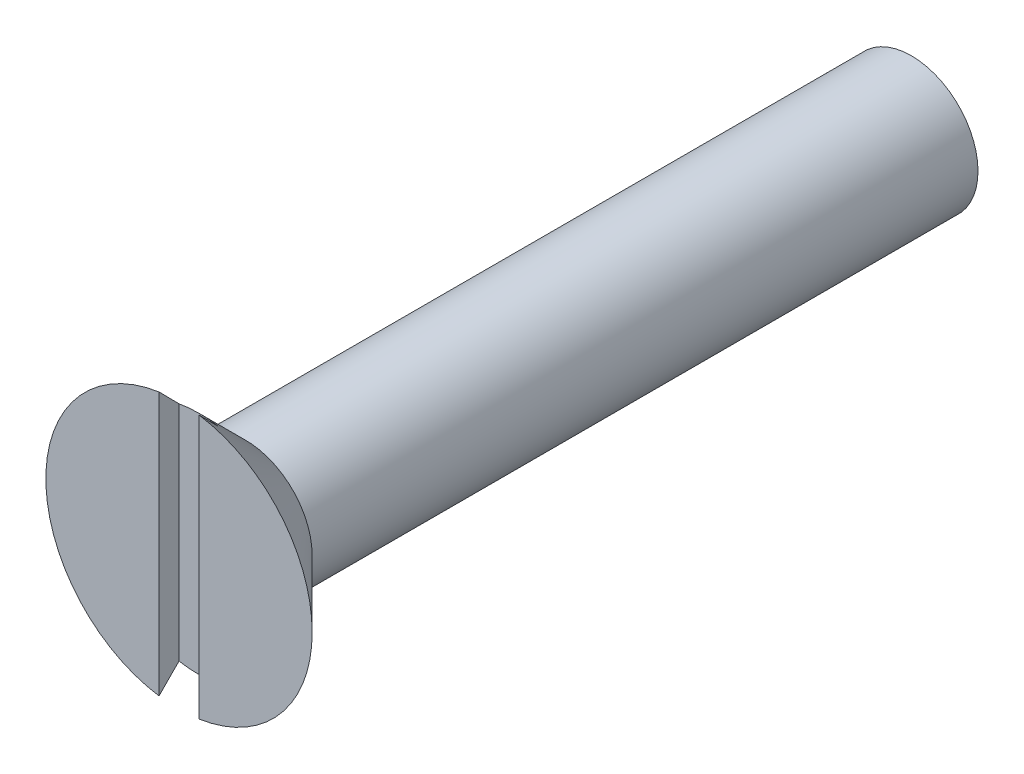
ISO-10303-21;
HEADER;
FILE_DESCRIPTION(('STEP AP214'),'2;1');
FILE_NAME('part.step','',(''),(''),'','','');
FILE_SCHEMA(('AUTOMOTIVE_DESIGN { 1 0 10303 214 1 1 1 1 }'));
ENDSEC;
DATA;
#1=APPLICATION_CONTEXT('core data for automotive mechanical design processes');
#2=APPLICATION_PROTOCOL_DEFINITION('international standard','automotive_design',2000,#1);
#3=PRODUCT_CONTEXT('',#1,'mechanical');
#4=PRODUCT('Part','Part','',(#3));
#5=PRODUCT_RELATED_PRODUCT_CATEGORY('part','',(#4));
#6=PRODUCT_DEFINITION_FORMATION('','',#4);
#7=PRODUCT_DEFINITION_CONTEXT('part definition',#1,'design');
#8=PRODUCT_DEFINITION('design','',#6,#7);
#9=PRODUCT_DEFINITION_SHAPE('','',#8);
#10=(LENGTH_UNIT() NAMED_UNIT(*) SI_UNIT(.MILLI.,.METRE.));
#11=(NAMED_UNIT(*) PLANE_ANGLE_UNIT() SI_UNIT($,.RADIAN.));
#12=(NAMED_UNIT(*) SI_UNIT($,.STERADIAN.) SOLID_ANGLE_UNIT());
#13=UNCERTAINTY_MEASURE_WITH_UNIT(LENGTH_MEASURE(1.E-05),#10,'distance_accuracy_value','');
#14=(GEOMETRIC_REPRESENTATION_CONTEXT(3) GLOBAL_UNCERTAINTY_ASSIGNED_CONTEXT((#13)) GLOBAL_UNIT_ASSIGNED_CONTEXT((#10,
#11,#12)) REPRESENTATION_CONTEXT('',''));
#15=CARTESIAN_POINT('',(0.,0.,0.));
#16=DIRECTION('',(0.,0.,1.));
#17=DIRECTION('',(1.,0.,0.));
#18=AXIS2_PLACEMENT_3D('',#15,#16,#17);
#19=CARTESIAN_POINT('',(0.,0.,0.));
#20=DIRECTION('',(0.,0.,1.));
#21=DIRECTION('',(1.,0.,0.));
#22=AXIS2_PLACEMENT_3D('',#19,#20,#21);
#23=PLANE('',#22);
#24=CARTESIAN_POINT('',(0.,0.,0.));
#25=DIRECTION('',(0.,0.,1.));
#26=DIRECTION('',(1.,0.,0.));
#27=AXIS2_PLACEMENT_3D('',#24,#25,#26);
#28=CIRCLE('',#27,2.);
#29=CARTESIAN_POINT('',(0.3,-1.97737199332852,0.));
#30=VERTEX_POINT('',#29);
#31=CARTESIAN_POINT('',(0.3,1.97737199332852,0.));
#32=VERTEX_POINT('',#31);
#33=EDGE_CURVE('E87',#30,#32,#28,.T.);
#34=ORIENTED_EDGE('',*,*,#33,.T.);
#35=DIRECTION('',(0.,-1.,0.));
#36=VECTOR('',#35,1.);
#37=CARTESIAN_POINT('',(0.3,-4.54142135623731,0.));
#38=LINE('',#37,#36);
#39=EDGE_CURVE('E77',#32,#30,#38,.T.);
#40=ORIENTED_EDGE('',*,*,#39,.T.);
#41=EDGE_LOOP('',(#34,#40));
#42=FACE_BOUND('',#41,.T.);
#43=ADVANCED_FACE('F31',(#42),#23,.T.);
#44=CARTESIAN_POINT('',(0.,0.,0.));
#45=DIRECTION('',(0.,0.,1.));
#46=DIRECTION('',(1.,0.,0.));
#47=AXIS2_PLACEMENT_3D('',#44,#45,#46);
#48=CONICAL_SURFACE('',#47,2.,0.78539816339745);
#49=CARTESIAN_POINT('',(0.,0.,-1.));
#50=DIRECTION('',(0.,0.,1.));
#51=DIRECTION('',(1.,0.,0.));
#52=AXIS2_PLACEMENT_3D('',#49,#50,#51);
#53=CIRCLE('',#52,0.999999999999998);
#54=CARTESIAN_POINT('',(0.999999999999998,0.,-1.));
#55=VERTEX_POINT('',#54);
#56=EDGE_CURVE('E96',#55,#55,#53,.F.);
#57=ORIENTED_EDGE('',*,*,#56,.F.);
#58=EDGE_LOOP('',(#57));
#59=FACE_BOUND('',#58,.T.);
#60=ORIENTED_EDGE('',*,*,#33,.F.);
#61=CARTESIAN_POINT('',(0.3,-4.35723583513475,2.36755127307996));
#62=CARTESIAN_POINT('',(0.3,-4.20650886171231,2.21718326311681));
#63=CARTESIAN_POINT('',(0.3,-4.05576625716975,2.06683090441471));
#64=CARTESIAN_POINT('',(0.3,-3.75422559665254,1.76617444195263));
#65=CARTESIAN_POINT('',(0.3,-3.60342753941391,1.61587033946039));
#66=CARTESIAN_POINT('',(0.3,-3.30167482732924,1.31525068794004));
#67=CARTESIAN_POINT('',(0.3,-3.15072013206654,1.16493517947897));
#68=CARTESIAN_POINT('',(0.3,-2.84870469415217,0.864417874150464));
#69=CARTESIAN_POINT('',(0.3,-2.6976439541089,0.714216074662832));
#70=CARTESIAN_POINT('',(0.3,-2.39501199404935,0.413663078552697));
#71=CARTESIAN_POINT('',(0.3,-2.24344038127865,0.263312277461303));
#72=CARTESIAN_POINT('',(0.3,-1.93997662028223,-0.0370872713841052));
#73=CARTESIAN_POINT('',(0.3,-1.78808445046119,-0.187135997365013));
#74=CARTESIAN_POINT('',(0.3,-1.55978354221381,-0.41168534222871));
#75=CARTESIAN_POINT('',(0.3,-1.48361955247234,-0.48643474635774));
#76=CARTESIAN_POINT('',(0.3,-1.3310320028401,-0.635673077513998));
#77=CARTESIAN_POINT('',(0.3,-1.2546084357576,-0.710161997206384));
#78=CARTESIAN_POINT('',(0.3,-1.10134132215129,-0.858686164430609));
#79=CARTESIAN_POINT('',(0.3,-1.02449783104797,-0.932721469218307));
#80=CARTESIAN_POINT('',(0.3,-0.870048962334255,-1.07999205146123));
#81=CARTESIAN_POINT('',(0.3,-0.792443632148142,-1.15322737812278));
#82=CARTESIAN_POINT('',(0.3,-0.692630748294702,-1.24523273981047));
#83=CARTESIAN_POINT('',(0.3,-0.6712087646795,-1.26485302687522));
#84=CARTESIAN_POINT('',(0.3,-0.628194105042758,-1.30390701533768));
#85=CARTESIAN_POINT('',(0.3,-0.606601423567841,-1.32334071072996));
#86=CARTESIAN_POINT('',(0.3,-0.563173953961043,-1.36198273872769));
#87=CARTESIAN_POINT('',(0.3,-0.541338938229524,-1.38119081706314));
#88=CARTESIAN_POINT('',(0.3,-0.497372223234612,-1.41925890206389));
#89=CARTESIAN_POINT('',(0.3,-0.475240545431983,-1.43811893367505));
#90=CARTESIAN_POINT('',(0.3,-0.416321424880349,-1.48726021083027));
#91=CARTESIAN_POINT('',(0.3,-0.379195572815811,-1.51714816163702));
#92=CARTESIAN_POINT('',(0.3,-0.322050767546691,-1.56004185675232));
#93=CARTESIAN_POINT('',(0.3,-0.302762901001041,-1.57401471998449));
#94=CARTESIAN_POINT('',(0.3,-0.26350754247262,-1.60096272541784));
#95=CARTESIAN_POINT('',(0.3,-0.243540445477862,-1.61393843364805));
#96=CARTESIAN_POINT('',(0.3,-0.20334327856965,-1.63792735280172));
#97=CARTESIAN_POINT('',(0.3,-0.183144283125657,-1.64899164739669));
#98=CARTESIAN_POINT('',(0.3,-0.141604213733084,-1.6687609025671));
#99=CARTESIAN_POINT('',(0.3,-0.120264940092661,-1.67746945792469));
#100=CARTESIAN_POINT('',(0.3,-0.0809502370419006,-1.6897055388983));
#101=CARTESIAN_POINT('',(0.3,-0.063202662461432,-1.69393516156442));
#102=CARTESIAN_POINT('',(0.3,-0.0272639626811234,-1.69928300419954));
#103=CARTESIAN_POINT('',(0.3,-0.00907417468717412,-1.70040965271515));
#104=CARTESIAN_POINT('',(0.3,0.0272221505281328,-1.69931595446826));
#105=CARTESIAN_POINT('',(0.3,0.0453285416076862,-1.69709107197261));
#106=CARTESIAN_POINT('',(0.3,0.080959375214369,-1.68976243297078));
#107=CARTESIAN_POINT('',(0.3,0.0984822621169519,-1.6846515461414));
#108=CARTESIAN_POINT('',(0.3,0.135914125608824,-1.67119599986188));
#109=CARTESIAN_POINT('',(0.3,0.155665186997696,-1.66242813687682));
#110=CARTESIAN_POINT('',(0.3,0.19423079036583,-1.64300207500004));
#111=CARTESIAN_POINT('',(0.3,0.213043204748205,-1.63233981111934));
#112=CARTESIAN_POINT('',(0.3,0.250084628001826,-1.60971073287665));
#113=CARTESIAN_POINT('',(0.3,0.26830693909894,-1.59773313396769));
#114=CARTESIAN_POINT('',(0.3,0.304163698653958,-1.57297643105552));
#115=CARTESIAN_POINT('',(0.3,0.321798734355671,-1.5601981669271));
#116=CARTESIAN_POINT('',(0.3,0.377839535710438,-1.51823511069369));
#117=CARTESIAN_POINT('',(0.3,0.415441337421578,-1.48798470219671));
#118=CARTESIAN_POINT('',(0.3,0.4895646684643,-1.4261811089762));
#119=CARTESIAN_POINT('',(0.3,0.526085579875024,-1.39462720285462));
#120=CARTESIAN_POINT('',(0.3,0.598524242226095,-1.33071705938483));
#121=CARTESIAN_POINT('',(0.3,0.634440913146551,-1.29835959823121));
#122=CARTESIAN_POINT('',(0.3,0.705838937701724,-1.23318881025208));
#123=CARTESIAN_POINT('',(0.3,0.741320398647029,-1.20037560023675));
#124=CARTESIAN_POINT('',(0.3,0.846985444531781,-1.10181840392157));
#125=CARTESIAN_POINT('',(0.3,0.916753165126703,-1.03562919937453));
#126=CARTESIAN_POINT('',(0.3,1.05565579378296,-0.902721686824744));
#127=CARTESIAN_POINT('',(0.3,1.12479122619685,-0.836003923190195));
#128=CARTESIAN_POINT('',(0.3,1.32673241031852,-0.640170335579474));
#129=CARTESIAN_POINT('',(0.3,1.45909445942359,-0.510597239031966));
#130=CARTESIAN_POINT('',(0.3,1.72330984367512,-0.250931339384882));
#131=CARTESIAN_POINT('',(0.3,1.85516316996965,-0.120838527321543));
#132=CARTESIAN_POINT('',(0.3,2.11864758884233,0.139690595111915));
#133=CARTESIAN_POINT('',(0.3,2.25027855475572,0.270127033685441));
#134=CARTESIAN_POINT('',(0.3,2.51337540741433,0.531164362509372));
#135=CARTESIAN_POINT('',(0.3,2.64484129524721,0.661765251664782));
#136=CARTESIAN_POINT('',(0.3,3.04009381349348,1.0547255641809));
#137=CARTESIAN_POINT('',(0.3,3.303724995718,1.31724134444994));
#138=CARTESIAN_POINT('',(0.3,3.69896427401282,1.71109506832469));
#139=CARTESIAN_POINT('',(0.3,3.83064413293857,1.84236106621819));
#140=CARTESIAN_POINT('',(0.3,4.0939658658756,2.10493052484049));
#141=CARTESIAN_POINT('',(0.3,4.22560773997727,2.23623398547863));
#142=CARTESIAN_POINT('',(0.3,4.35723583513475,2.36755127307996));
#143=B_SPLINE_CURVE_WITH_KNOTS('',3,(#61,#62,#63,#64,#65,#66,#67,#68,#69,#70,#71,#72,#73,#74,
#75,#76,#77,#78,#79,#80,#81,#82,#83,#84,#85,#86,#87,#88,#89,#90,#91,#92,#93,#94,#95,#96,#97,#98,
#99,#100,#101,#102,#103,#104,#105,#106,#107,#108,#109,#110,#111,#112,#113,#114,#115,#116,#117,
#118,#119,#120,#121,#122,#123,#124,#125,#126,#127,#128,#129,#130,#131,#132,#133,#134,#135,#136,
#137,#138,#139,#140,#141,#142),.UNSPECIFIED.,.F.,.F.,(4,2,2,2,2,2,2,2,2,2,2,2,2,2,2,2,2,2,2,2,2,
2,2,2,2,2,2,2,2,2,2,2,2,2,2,2,2,2,2,2,4),(0.,0.638719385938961,1.27745436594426,
1.91654639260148,2.55562321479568,3.19610253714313,3.83662648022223,4.15677597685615,
4.47693441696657,4.79705157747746,5.11714893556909,5.20429565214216,5.29144516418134,
5.37868494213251,5.4659184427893,5.60882875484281,5.68026197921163,5.75165435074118,
5.82066147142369,5.88956268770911,5.94407872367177,5.99844653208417,6.0528879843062,
6.10746453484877,6.17213269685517,6.23694133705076,6.30232785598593,6.36764689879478,
6.51234963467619,6.65713355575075,6.80215344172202,6.94713682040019,7.2356357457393,
7.52386855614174,8.07954320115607,8.63522747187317,9.19116173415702,9.74709231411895,
10.8632207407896,11.421013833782,11.9788055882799),.UNSPECIFIED.);
#144=CARTESIAN_POINT('',(0.3,-1.67332005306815,-0.3));
#145=VERTEX_POINT('',#144);
#146=EDGE_CURVE('E11',#30,#145,#143,.T.);
#147=ORIENTED_EDGE('',*,*,#146,.T.);
#148=CARTESIAN_POINT('',(0.,0.,-0.3));
#149=DIRECTION('',(0.,0.,1.));
#150=DIRECTION('',(1.,0.,0.));
#151=AXIS2_PLACEMENT_3D('',#148,#149,#150);
#152=CIRCLE('',#151,1.7);
#153=CARTESIAN_POINT('',(-0.3,-1.67332005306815,-0.3));
#154=VERTEX_POINT('',#153);
#155=EDGE_CURVE('E90',#145,#154,#152,.F.);
#156=ORIENTED_EDGE('',*,*,#155,.T.);
#157=CARTESIAN_POINT('',(-0.3,-4.35723583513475,2.36755127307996));
#158=CARTESIAN_POINT('',(-0.3,-4.20650886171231,2.21718326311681));
#159=CARTESIAN_POINT('',(-0.3,-4.05576625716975,2.06683090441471));
#160=CARTESIAN_POINT('',(-0.3,-3.75422559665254,1.76617444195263));
#161=CARTESIAN_POINT('',(-0.3,-3.60342753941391,1.61587033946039));
#162=CARTESIAN_POINT('',(-0.3,-3.30167482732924,1.31525068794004));
#163=CARTESIAN_POINT('',(-0.3,-3.15072013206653,1.16493517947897));
#164=CARTESIAN_POINT('',(-0.3,-2.84870469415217,0.864417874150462));
#165=CARTESIAN_POINT('',(-0.3,-2.6976439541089,0.71421607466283));
#166=CARTESIAN_POINT('',(-0.3,-2.39501199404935,0.413663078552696));
#167=CARTESIAN_POINT('',(-0.3,-2.24344038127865,0.263312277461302));
#168=CARTESIAN_POINT('',(-0.3,-1.93997662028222,-0.0370872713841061));
#169=CARTESIAN_POINT('',(-0.3,-1.78808445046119,-0.187135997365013));
#170=CARTESIAN_POINT('',(-0.3,-1.55978354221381,-0.411685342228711));
#171=CARTESIAN_POINT('',(-0.3,-1.48361955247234,-0.486434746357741));
#172=CARTESIAN_POINT('',(-0.3,-1.3310320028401,-0.635673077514));
#173=CARTESIAN_POINT('',(-0.3,-1.2546084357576,-0.710161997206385));
#174=CARTESIAN_POINT('',(-0.3,-1.10134132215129,-0.85868616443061));
#175=CARTESIAN_POINT('',(-0.3,-1.02449783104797,-0.932721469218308));
#176=CARTESIAN_POINT('',(-0.3,-0.870048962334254,-1.07999205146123));
#177=CARTESIAN_POINT('',(-0.3,-0.792443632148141,-1.15322737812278));
#178=CARTESIAN_POINT('',(-0.3,-0.692630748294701,-1.24523273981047));
#179=CARTESIAN_POINT('',(-0.3,-0.671208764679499,-1.26485302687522));
#180=CARTESIAN_POINT('',(-0.3,-0.628194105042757,-1.30390701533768));
#181=CARTESIAN_POINT('',(-0.3,-0.60660142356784,-1.32334071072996));
#182=CARTESIAN_POINT('',(-0.3,-0.563173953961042,-1.36198273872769));
#183=CARTESIAN_POINT('',(-0.3,-0.541338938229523,-1.38119081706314));
#184=CARTESIAN_POINT('',(-0.3,-0.497372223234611,-1.41925890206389));
#185=CARTESIAN_POINT('',(-0.3,-0.475240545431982,-1.43811893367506));
#186=CARTESIAN_POINT('',(-0.3,-0.416321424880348,-1.48726021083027));
#187=CARTESIAN_POINT('',(-0.3,-0.37919557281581,-1.51714816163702));
#188=CARTESIAN_POINT('',(-0.3,-0.32205076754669,-1.56004185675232));
#189=CARTESIAN_POINT('',(-0.3,-0.30276290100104,-1.57401471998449));
#190=CARTESIAN_POINT('',(-0.3,-0.263507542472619,-1.60096272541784));
#191=CARTESIAN_POINT('',(-0.3,-0.243540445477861,-1.61393843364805));
#192=CARTESIAN_POINT('',(-0.3,-0.203343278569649,-1.63792735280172));
#193=CARTESIAN_POINT('',(-0.3,-0.183144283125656,-1.64899164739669));
#194=CARTESIAN_POINT('',(-0.3,-0.141604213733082,-1.6687609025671));
#195=CARTESIAN_POINT('',(-0.3,-0.12026494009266,-1.67746945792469));
#196=CARTESIAN_POINT('',(-0.3,-0.0809502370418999,-1.6897055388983));
#197=CARTESIAN_POINT('',(-0.3,-0.0632026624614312,-1.69393516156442));
#198=CARTESIAN_POINT('',(-0.3,-0.0272639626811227,-1.69928300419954));
#199=CARTESIAN_POINT('',(-0.3,-0.00907417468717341,-1.70040965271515));
#200=CARTESIAN_POINT('',(-0.3,0.0272221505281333,-1.69931595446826));
#201=CARTESIAN_POINT('',(-0.3,0.0453285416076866,-1.69709107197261));
#202=CARTESIAN_POINT('',(-0.3,0.0809593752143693,-1.68976243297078));
#203=CARTESIAN_POINT('',(-0.3,0.0984822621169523,-1.6846515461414));
#204=CARTESIAN_POINT('',(-0.3,0.135914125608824,-1.67119599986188));
#205=CARTESIAN_POINT('',(-0.3,0.155665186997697,-1.66242813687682));
#206=CARTESIAN_POINT('',(-0.3,0.194230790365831,-1.64300207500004));
#207=CARTESIAN_POINT('',(-0.3,0.213043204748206,-1.63233981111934));
#208=CARTESIAN_POINT('',(-0.3,0.250084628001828,-1.60971073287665));
#209=CARTESIAN_POINT('',(-0.3,0.268306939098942,-1.59773313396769));
#210=CARTESIAN_POINT('',(-0.3,0.30416369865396,-1.57297643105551));
#211=CARTESIAN_POINT('',(-0.3,0.321798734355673,-1.5601981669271));
#212=CARTESIAN_POINT('',(-0.3,0.37783953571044,-1.51823511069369));
#213=CARTESIAN_POINT('',(-0.3,0.41544133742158,-1.48798470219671));
#214=CARTESIAN_POINT('',(-0.3,0.489564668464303,-1.42618110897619));
#215=CARTESIAN_POINT('',(-0.3,0.526085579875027,-1.39462720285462));
#216=CARTESIAN_POINT('',(-0.3,0.598524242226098,-1.33071705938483));
#217=CARTESIAN_POINT('',(-0.3,0.634440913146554,-1.29835959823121));
#218=CARTESIAN_POINT('',(-0.3,0.705838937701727,-1.23318881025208));
#219=CARTESIAN_POINT('',(-0.3,0.741320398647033,-1.20037560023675));
#220=CARTESIAN_POINT('',(-0.3,0.846985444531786,-1.10181840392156));
#221=CARTESIAN_POINT('',(-0.3,0.916753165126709,-1.03562919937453));
#222=CARTESIAN_POINT('',(-0.3,1.05565579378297,-0.902721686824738));
#223=CARTESIAN_POINT('',(-0.3,1.12479122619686,-0.836003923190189));
#224=CARTESIAN_POINT('',(-0.3,1.32673241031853,-0.640170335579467));
#225=CARTESIAN_POINT('',(-0.3,1.45909445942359,-0.510597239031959));
#226=CARTESIAN_POINT('',(-0.3,1.72330984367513,-0.250931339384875));
#227=CARTESIAN_POINT('',(-0.3,1.85516316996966,-0.120838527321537));
#228=CARTESIAN_POINT('',(-0.3,2.11864758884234,0.139690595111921));
#229=CARTESIAN_POINT('',(-0.3,2.25027855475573,0.270127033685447));
#230=CARTESIAN_POINT('',(-0.3,2.51337540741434,0.531164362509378));
#231=CARTESIAN_POINT('',(-0.3,2.64484129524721,0.661765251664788));
#232=CARTESIAN_POINT('',(-0.3,3.04009381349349,1.0547255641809));
#233=CARTESIAN_POINT('',(-0.3,3.30372499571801,1.31724134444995));
#234=CARTESIAN_POINT('',(-0.3,3.69896427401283,1.71109506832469));
#235=CARTESIAN_POINT('',(-0.3,3.83064413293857,1.84236106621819));
#236=CARTESIAN_POINT('',(-0.3,4.0939658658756,2.10493052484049));
#237=CARTESIAN_POINT('',(-0.3,4.22560773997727,2.23623398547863));
#238=CARTESIAN_POINT('',(-0.3,4.35723583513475,2.36755127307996));
#239=B_SPLINE_CURVE_WITH_KNOTS('',3,(#157,#158,#159,#160,#161,#162,#163,#164,#165,#166,#167,
#168,#169,#170,#171,#172,#173,#174,#175,#176,#177,#178,#179,#180,#181,#182,#183,#184,#185,#186,
#187,#188,#189,#190,#191,#192,#193,#194,#195,#196,#197,#198,#199,#200,#201,#202,#203,#204,#205,
#206,#207,#208,#209,#210,#211,#212,#213,#214,#215,#216,#217,#218,#219,#220,#221,#222,#223,#224,
#225,#226,#227,#228,#229,#230,#231,#232,#233,#234,#235,#236,#237,#238),.UNSPECIFIED.,.F.,.F.,(4,
2,2,2,2,2,2,2,2,2,2,2,2,2,2,2,2,2,2,2,2,2,2,2,2,2,2,2,2,2,2,2,2,2,2,2,2,2,2,2,4),(0.,
0.638719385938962,1.27745436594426,1.91654639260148,2.55562321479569,3.19610253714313,
3.83662648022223,4.15677597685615,4.47693441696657,4.79705157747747,5.11714893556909,
5.20429565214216,5.29144516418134,5.37868494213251,5.4659184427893,5.60882875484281,
5.68026197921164,5.75165435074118,5.8206614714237,5.88956268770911,5.94407872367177,
5.99844653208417,6.0528879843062,6.10746453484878,6.17213269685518,6.23694133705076,
6.30232785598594,6.36764689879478,6.5123496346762,6.65713355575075,6.80215344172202,
6.94713682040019,7.23563574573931,7.52386855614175,8.07954320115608,8.63522747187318,
9.19116173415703,9.74709231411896,10.8632207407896,11.421013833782,11.9788055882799),.UNSPECIFIED.);
#240=CARTESIAN_POINT('',(-0.3,-1.97737199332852,0.));
#241=VERTEX_POINT('',#240);
#242=EDGE_CURVE('E45',#241,#154,#239,.T.);
#243=ORIENTED_EDGE('',*,*,#242,.F.);
#244=CARTESIAN_POINT('',(-0.3,1.97737199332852,0.));
#245=VERTEX_POINT('',#244);
#246=EDGE_CURVE('E92',#245,#241,#28,.T.);
#247=ORIENTED_EDGE('',*,*,#246,.F.);
#248=CARTESIAN_POINT('',(-0.3,1.67332005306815,-0.3));
#249=VERTEX_POINT('',#248);
#250=EDGE_CURVE('E91',#249,#245,#239,.T.);
#251=ORIENTED_EDGE('',*,*,#250,.F.);
#252=CARTESIAN_POINT('',(0.3,1.67332005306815,-0.3));
#253=VERTEX_POINT('',#252);
#254=EDGE_CURVE('E89',#249,#253,#152,.F.);
#255=ORIENTED_EDGE('',*,*,#254,.T.);
#256=EDGE_CURVE('E36',#253,#32,#143,.T.);
#257=ORIENTED_EDGE('',*,*,#256,.T.);
#258=EDGE_LOOP('',(#60,#147,#156,#243,#247,#251,#255,#257));
#259=FACE_BOUND('',#258,.T.);
#260=ADVANCED_FACE('F33',(#59,#259),#48,.T.);
#261=DIRECTION('',(0.,-1.,0.));
#262=VECTOR('',#261,1.);
#263=CARTESIAN_POINT('',(-0.3,-4.54142135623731,0.));
#264=LINE('',#263,#262);
#265=EDGE_CURVE('E84',#245,#241,#264,.T.);
#266=ORIENTED_EDGE('',*,*,#265,.F.);
#267=ORIENTED_EDGE('',*,*,#246,.T.);
#268=EDGE_LOOP('',(#266,#267));
#269=FACE_BOUND('',#268,.T.);
#270=ADVANCED_FACE('F122',(#269),#23,.T.);
#271=CARTESIAN_POINT('',(0.,0.,-11.));
#272=DIRECTION('',(0.,0.,1.));
#273=DIRECTION('',(1.,0.,0.));
#274=AXIS2_PLACEMENT_3D('',#271,#272,#273);
#275=CYLINDRICAL_SURFACE('',#274,0.999999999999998);
#276=CARTESIAN_POINT('',(0.,0.,-11.));
#277=DIRECTION('',(0.,0.,-1.));
#278=DIRECTION('',(-1.,0.,0.));
#279=AXIS2_PLACEMENT_3D('',#276,#277,#278);
#280=CIRCLE('',#279,0.999999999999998);
#281=CARTESIAN_POINT('',(-0.999999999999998,0.,-11.));
#282=VERTEX_POINT('',#281);
#283=EDGE_CURVE('E93',#282,#282,#280,.T.);
#284=ORIENTED_EDGE('',*,*,#283,.F.);
#285=EDGE_LOOP('',(#284));
#286=FACE_BOUND('',#285,.T.);
#287=ORIENTED_EDGE('',*,*,#56,.T.);
#288=EDGE_LOOP('',(#287));
#289=FACE_BOUND('',#288,.T.);
#290=ADVANCED_FACE('F119',(#286,#289),#275,.T.);
#291=CARTESIAN_POINT('',(0.,0.,-11.));
#292=DIRECTION('',(0.,0.,-1.));
#293=DIRECTION('',(-1.,0.,0.));
#294=AXIS2_PLACEMENT_3D('',#291,#292,#293);
#295=PLANE('',#294);
#296=ORIENTED_EDGE('',*,*,#283,.T.);
#297=EDGE_LOOP('',(#296));
#298=FACE_BOUND('',#297,.T.);
#299=ADVANCED_FACE('F116',(#298),#295,.T.);
#300=CARTESIAN_POINT('',(0.3,-4.54142135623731,-0.3));
#301=DIRECTION('',(-1.,0.,0.));
#302=DIRECTION('',(0.,0.,1.));
#303=AXIS2_PLACEMENT_3D('',#300,#301,#302);
#304=PLANE('',#303);
#305=ORIENTED_EDGE('',*,*,#39,.F.);
#306=ORIENTED_EDGE('',*,*,#256,.F.);
#307=DIRECTION('',(0.,-1.,0.));
#308=VECTOR('',#307,1.);
#309=CARTESIAN_POINT('',(0.3,-4.54142135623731,-0.3));
#310=LINE('',#309,#308);
#311=EDGE_CURVE('E52',#253,#145,#310,.T.);
#312=ORIENTED_EDGE('',*,*,#311,.T.);
#313=ORIENTED_EDGE('',*,*,#146,.F.);
#314=EDGE_LOOP('',(#305,#306,#312,#313));
#315=FACE_BOUND('',#314,.T.);
#316=ADVANCED_FACE('F79',(#315),#304,.T.);
#317=CARTESIAN_POINT('',(-0.3,-4.54142135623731,-0.3));
#318=DIRECTION('',(-1.,0.,0.));
#319=DIRECTION('',(0.,0.,1.));
#320=AXIS2_PLACEMENT_3D('',#317,#318,#319);
#321=PLANE('',#320);
#322=ORIENTED_EDGE('',*,*,#242,.T.);
#323=DIRECTION('',(0.,-1.,0.));
#324=VECTOR('',#323,1.);
#325=CARTESIAN_POINT('',(-0.3,-4.54142135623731,-0.3));
#326=LINE('',#325,#324);
#327=EDGE_CURVE('E98',#249,#154,#326,.T.);
#328=ORIENTED_EDGE('',*,*,#327,.F.);
#329=ORIENTED_EDGE('',*,*,#250,.T.);
#330=ORIENTED_EDGE('',*,*,#265,.T.);
#331=EDGE_LOOP('',(#322,#328,#329,#330));
#332=FACE_BOUND('',#331,.T.);
#333=ADVANCED_FACE('F108',(#332),#321,.F.);
#334=CARTESIAN_POINT('',(0.,-4.54142135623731,-0.3));
#335=DIRECTION('',(0.,0.,1.));
#336=DIRECTION('',(1.,0.,0.));
#337=AXIS2_PLACEMENT_3D('',#334,#335,#336);
#338=PLANE('',#337);
#339=ORIENTED_EDGE('',*,*,#311,.F.);
#340=ORIENTED_EDGE('',*,*,#254,.F.);
#341=ORIENTED_EDGE('',*,*,#327,.T.);
#342=ORIENTED_EDGE('',*,*,#155,.F.);
#343=EDGE_LOOP('',(#339,#340,#341,#342));
#344=FACE_BOUND('',#343,.T.);
#345=ADVANCED_FACE('F112',(#344),#338,.T.);
#346=CLOSED_SHELL('',(#43,#260,#270,#290,#299,#316,#333,#345));
#347=MANIFOLD_SOLID_BREP('B2',#346);
#348=ADVANCED_BREP_SHAPE_REPRESENTATION('',(#18,#347),#14);
#349=SHAPE_DEFINITION_REPRESENTATION(#9,#348);
ENDSEC;
END-ISO-10303-21;
